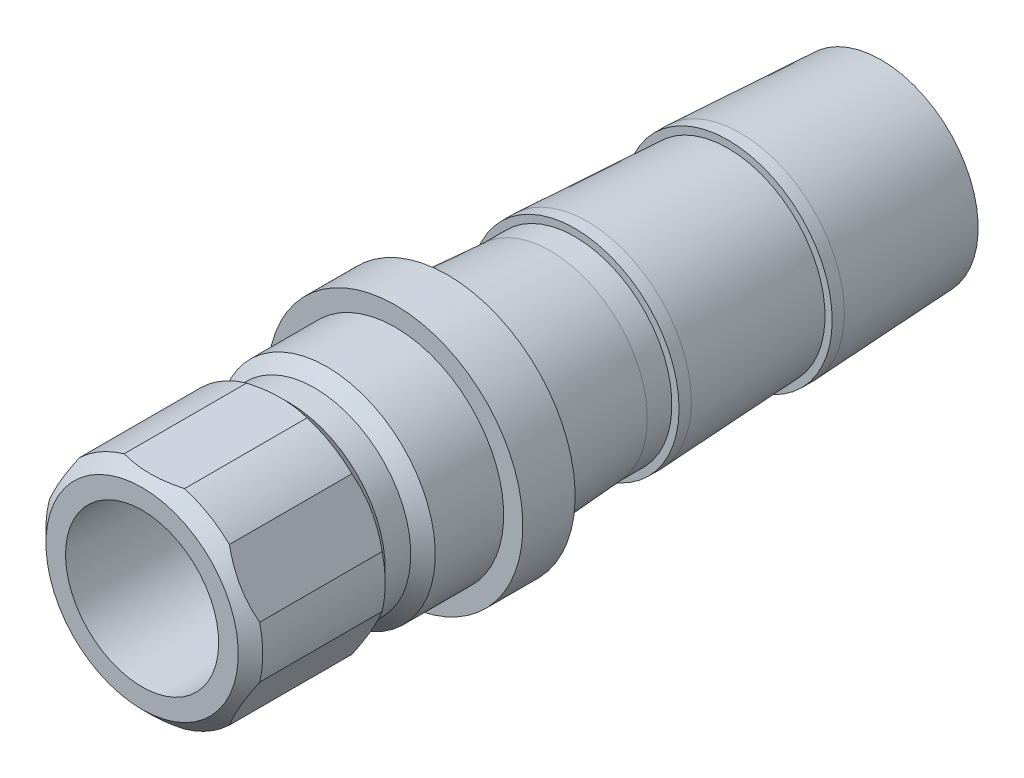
ISO-10303-21;
HEADER;
FILE_DESCRIPTION(('STEP AP214'),'2;1');
FILE_NAME('part.step','',(''),(''),'','','');
FILE_SCHEMA(('AUTOMOTIVE_DESIGN { 1 0 10303 214 1 1 1 1 }'));
ENDSEC;
DATA;
#1=APPLICATION_CONTEXT('core data for automotive mechanical design processes');
#2=APPLICATION_PROTOCOL_DEFINITION('international standard','automotive_design',2000,#1);
#3=PRODUCT_CONTEXT('',#1,'mechanical');
#4=PRODUCT('Part','Part','',(#3));
#5=PRODUCT_RELATED_PRODUCT_CATEGORY('part','',(#4));
#6=PRODUCT_DEFINITION_FORMATION('','',#4);
#7=PRODUCT_DEFINITION_CONTEXT('part definition',#1,'design');
#8=PRODUCT_DEFINITION('design','',#6,#7);
#9=PRODUCT_DEFINITION_SHAPE('','',#8);
#10=(LENGTH_UNIT() NAMED_UNIT(*) SI_UNIT(.MILLI.,.METRE.));
#11=(NAMED_UNIT(*) PLANE_ANGLE_UNIT() SI_UNIT($,.RADIAN.));
#12=(NAMED_UNIT(*) SI_UNIT($,.STERADIAN.) SOLID_ANGLE_UNIT());
#13=UNCERTAINTY_MEASURE_WITH_UNIT(LENGTH_MEASURE(1.E-05),#10,'distance_accuracy_value','');
#14=(GEOMETRIC_REPRESENTATION_CONTEXT(3) GLOBAL_UNCERTAINTY_ASSIGNED_CONTEXT((#13)) GLOBAL_UNIT_ASSIGNED_CONTEXT((#10,
#11,#12)) REPRESENTATION_CONTEXT('',''));
#15=CARTESIAN_POINT('',(0.,0.,0.));
#16=DIRECTION('',(0.,0.,1.));
#17=DIRECTION('',(1.,0.,0.));
#18=AXIS2_PLACEMENT_3D('',#15,#16,#17);
#19=CARTESIAN_POINT('',(0.,0.,14.986));
#20=DIRECTION('',(0.,0.,-1.));
#21=DIRECTION('',(0.,1.,0.));
#22=AXIS2_PLACEMENT_3D('',#19,#20,#21);
#23=CONICAL_SURFACE('',#22,6.7437,0.785398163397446);
#24=CARTESIAN_POINT('',(0.,0.,15.748));
#25=DIRECTION('',(0.,0.,-1.));
#26=DIRECTION('',(0.,1.,0.));
#27=AXIS2_PLACEMENT_3D('',#24,#25,#26);
#28=CIRCLE('',#27,5.9817);
#29=CARTESIAN_POINT('',(0.,5.9817,15.748));
#30=VERTEX_POINT('',#29);
#31=EDGE_CURVE('E162',#30,#30,#28,.T.);
#32=ORIENTED_EDGE('',*,*,#31,.T.);
#33=EDGE_LOOP('',(#32));
#34=FACE_BOUND('',#33,.T.);
#35=CARTESIAN_POINT('',(0.,0.,14.986));
#36=DIRECTION('',(0.,0.,-1.));
#37=DIRECTION('',(0.,1.,0.));
#38=AXIS2_PLACEMENT_3D('',#35,#36,#37);
#39=CIRCLE('',#38,6.7437);
#40=CARTESIAN_POINT('',(1.8777541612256,6.47699999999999,14.986));
#41=VERTEX_POINT('',#40);
#42=CARTESIAN_POINT('',(4.67036945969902,4.86468280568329,14.986));
#43=VERTEX_POINT('',#42);
#44=EDGE_CURVE('E159',#41,#43,#39,.T.);
#45=ORIENTED_EDGE('',*,*,#44,.F.);
#46=CARTESIAN_POINT('',(-7.31595245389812,6.477,11.9585849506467));
#47=CARTESIAN_POINT('',(-7.13716192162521,6.477,12.09242068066));
#48=CARTESIAN_POINT('',(-6.95735466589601,6.477,12.2249205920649));
#49=CARTESIAN_POINT('',(-6.59531185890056,6.477,12.4866559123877));
#50=CARTESIAN_POINT('',(-6.41307569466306,6.477,12.6158904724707));
#51=CARTESIAN_POINT('',(-6.04444818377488,6.477,12.8714195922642));
#52=CARTESIAN_POINT('',(-5.85803557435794,6.477,12.9976835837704));
#53=CARTESIAN_POINT('',(-5.4820225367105,6.477,13.245356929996));
#54=CARTESIAN_POINT('',(-5.29242233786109,6.477,13.3667666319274));
#55=CARTESIAN_POINT('',(-4.89908247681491,6.477,13.6101330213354));
#56=CARTESIAN_POINT('',(-4.69513615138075,6.477,13.7317573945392));
#57=CARTESIAN_POINT('',(-4.2824994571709,6.477,13.9668032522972));
#58=CARTESIAN_POINT('',(-4.07380836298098,6.477,14.0802234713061));
#59=CARTESIAN_POINT('',(-3.65173370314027,6.477,14.2964010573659));
#60=CARTESIAN_POINT('',(-3.43836632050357,6.477,14.3991897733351));
#61=CARTESIAN_POINT('',(-3.0059059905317,6.477,14.59180459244));
#62=CARTESIAN_POINT('',(-2.78681563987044,6.477,14.6816364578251));
#63=CARTESIAN_POINT('',(-2.35869152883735,6.477,14.8392509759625));
#64=CARTESIAN_POINT('',(-2.15007621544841,6.477,14.9081583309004));
#65=CARTESIAN_POINT('',(-1.72794730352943,6.477,15.029215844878));
#66=CARTESIAN_POINT('',(-1.51443335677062,6.477,15.0813648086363));
#67=CARTESIAN_POINT('',(-1.08726616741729,6.477,15.1653541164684));
#68=CARTESIAN_POINT('',(-0.873680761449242,6.477,15.1975339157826));
#69=CARTESIAN_POINT('',(-0.444382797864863,6.477,15.2409825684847));
#70=CARTESIAN_POINT('',(-0.228670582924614,6.477,15.2522547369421));
#71=CARTESIAN_POINT('',(0.195590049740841,6.477,15.2531049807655));
#72=CARTESIAN_POINT('',(0.404137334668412,6.477,15.2433943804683));
#73=CARTESIAN_POINT('',(0.819375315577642,6.477,15.2043531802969));
#74=CARTESIAN_POINT('',(1.026065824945,6.477,15.1750206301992));
#75=CARTESIAN_POINT('',(1.43958683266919,6.477,15.0978125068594));
#76=CARTESIAN_POINT('',(1.64635839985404,6.477,15.0496261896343));
#77=CARTESIAN_POINT('',(2.05541277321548,6.477,14.937237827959));
#78=CARTESIAN_POINT('',(2.25769600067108,6.477,14.8730372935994));
#79=CARTESIAN_POINT('',(2.67942290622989,6.477,14.7234325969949));
#80=CARTESIAN_POINT('',(2.89830973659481,6.477,14.6364736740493));
#81=CARTESIAN_POINT('',(3.33036785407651,6.477,14.4492510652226));
#82=CARTESIAN_POINT('',(3.5435363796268,6.477,14.3489810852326));
#83=CARTESIAN_POINT('',(3.96521765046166,6.477,14.1375266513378));
#84=CARTESIAN_POINT('',(4.17371291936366,6.477,14.026307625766));
#85=CARTESIAN_POINT('',(4.58589470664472,6.477,13.7954185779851));
#86=CARTESIAN_POINT('',(4.78958199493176,6.477,13.6757499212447));
#87=CARTESIAN_POINT('',(5.18271200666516,6.477,13.4357848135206));
#88=CARTESIAN_POINT('',(5.37235766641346,6.477,13.3158190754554));
#89=CARTESIAN_POINT('',(5.74839484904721,6.477,13.0708760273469));
#90=CARTESIAN_POINT('',(5.93478612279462,6.47699999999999,12.9458983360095));
#91=CARTESIAN_POINT('',(6.30322303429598,6.47699999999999,12.6928680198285));
#92=CARTESIAN_POINT('',(6.48529173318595,6.47699999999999,12.5648488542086));
#93=CARTESIAN_POINT('',(6.84694630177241,6.47699999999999,12.3054498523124));
#94=CARTESIAN_POINT('',(7.02653283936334,6.47699999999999,12.174070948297));
#95=CARTESIAN_POINT('',(7.20508094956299,6.47699999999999,12.041319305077));
#96=B_SPLINE_CURVE_WITH_KNOTS('',3,(#46,#47,#48,#49,#50,#51,#52,#53,#54,#55,#56,#57,#58,#59,#60,
#61,#62,#63,#64,#65,#66,#67,#68,#69,#70,#71,#72,#73,#74,#75,#76,#77,#78,#79,#80,#81,#82,#83,#84,
#85,#86,#87,#88,#89,#90,#91,#92,#93,#94,#95),.UNSPECIFIED.,.F.,.F.,(4,2,2,2,2,2,2,2,2,2,2,2,2,2,
2,2,2,2,2,2,2,2,2,2,4),(0.,0.670015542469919,1.34020350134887,2.01558827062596,2.69092464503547,
3.4031470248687,4.11547903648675,4.82564684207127,5.53549783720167,6.19401709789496,
6.85258331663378,7.49962373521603,8.14656155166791,8.77191276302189,9.39732613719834,
10.0335138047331,10.6696415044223,11.3756703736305,12.0820342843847,12.7907048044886,
13.4992610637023,14.1723809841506,14.845552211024,15.5132243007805,16.1807130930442),.UNSPECIFIED.);
#97=CARTESIAN_POINT('',(-1.87775416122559,6.477,14.986));
#98=VERTEX_POINT('',#97);
#99=EDGE_CURVE('E320',#41,#98,#96,.F.);
#100=ORIENTED_EDGE('',*,*,#99,.T.);
#101=CARTESIAN_POINT('',(-4.67036945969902,4.8646828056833,14.986));
#102=VERTEX_POINT('',#101);
#103=EDGE_CURVE('E156',#102,#98,#39,.T.);
#104=ORIENTED_EDGE('',*,*,#103,.F.);
#105=CARTESIAN_POINT('',(-4.67001038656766,4.86530473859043,14.9858));
#106=CARTESIAN_POINT('',(-4.75109443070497,4.72486305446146,15.0310202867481));
#107=CARTESIAN_POINT('',(-4.83292416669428,4.58312979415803,15.0711660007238));
#108=CARTESIAN_POINT('',(-4.99782619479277,4.2975111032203,15.1402365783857));
#109=CARTESIAN_POINT('',(-5.08089948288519,4.15362394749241,15.1691518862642));
#110=CARTESIAN_POINT('',(-5.24618595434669,3.86733938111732,15.2141425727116));
#111=CARTESIAN_POINT('',(-5.32838175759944,3.72497207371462,15.2304694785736));
#112=CARTESIAN_POINT('',(-5.49312242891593,3.43963286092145,15.2506210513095));
#113=CARTESIAN_POINT('',(-5.57566711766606,3.29666126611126,15.2544515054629));
#114=CARTESIAN_POINT('',(-5.73267022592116,3.0247239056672,15.2497120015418));
#115=CARTESIAN_POINT('',(-5.80713811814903,2.89574173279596,15.2423062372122));
#116=CARTESIAN_POINT('',(-5.95567411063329,2.63846984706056,15.2174303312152));
#117=CARTESIAN_POINT('',(-6.02974207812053,2.51018036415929,15.1999570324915));
#118=CARTESIAN_POINT('',(-6.17854717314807,2.25244237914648,15.1550584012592));
#119=CARTESIAN_POINT('',(-6.2532703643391,2.12301801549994,15.127450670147));
#120=CARTESIAN_POINT('',(-6.40168890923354,1.86594955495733,15.0631944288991));
#121=CARTESIAN_POINT('',(-6.4753849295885,1.7383043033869,15.0265521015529));
#122=CARTESIAN_POINT('',(-6.54848269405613,1.61169526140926,14.9857999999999));
#123=B_SPLINE_CURVE_WITH_KNOTS('',3,(#105,#106,#107,#108,#109,#110,#111,#112,#113,#114,#115,
#116,#117,#118,#119,#120,#121,#122),.UNSPECIFIED.,.F.,.F.,(4,2,2,2,2,2,2,2,4),(0.,
0.505093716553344,1.01061627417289,1.50575564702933,2.00066568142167,2.44768005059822,
2.89483467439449,3.35046683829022,3.80578805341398),.UNSPECIFIED.);
#124=CARTESIAN_POINT('',(-6.5481236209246,1.6123171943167,14.986));
#125=VERTEX_POINT('',#124);
#126=EDGE_CURVE('E191',#102,#125,#123,.T.);
#127=ORIENTED_EDGE('',*,*,#126,.T.);
#128=CARTESIAN_POINT('',(-6.5481236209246,-1.61231719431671,14.986));
#129=VERTEX_POINT('',#128);
#130=EDGE_CURVE('E143',#129,#125,#39,.T.);
#131=ORIENTED_EDGE('',*,*,#130,.F.);
#132=CARTESIAN_POINT('',(-6.5484826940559,-1.61169526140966,14.9858));
#133=CARTESIAN_POINT('',(-6.4673986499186,-1.75213694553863,15.0310202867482));
#134=CARTESIAN_POINT('',(-6.38556891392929,-1.89387020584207,15.0711660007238));
#135=CARTESIAN_POINT('',(-6.2206668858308,-2.1794888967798,15.1402365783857));
#136=CARTESIAN_POINT('',(-6.13759359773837,-2.32337605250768,15.1691518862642));
#137=CARTESIAN_POINT('',(-5.97230712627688,-2.60966061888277,15.2141425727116));
#138=CARTESIAN_POINT('',(-5.89011132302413,-2.75202792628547,15.2304694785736));
#139=CARTESIAN_POINT('',(-5.72537065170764,-3.03736713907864,15.2506210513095));
#140=CARTESIAN_POINT('',(-5.64282596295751,-3.18033873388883,15.2544515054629));
#141=CARTESIAN_POINT('',(-5.48582285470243,-3.45227609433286,15.2497120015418));
#142=CARTESIAN_POINT('',(-5.41135496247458,-3.58125826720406,15.2423062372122));
#143=CARTESIAN_POINT('',(-5.26281896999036,-3.83853015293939,15.2174303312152));
#144=CARTESIAN_POINT('',(-5.18875100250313,-3.96681963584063,15.1999570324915));
#145=CARTESIAN_POINT('',(-5.03994590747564,-4.22455762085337,15.1550584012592));
#146=CARTESIAN_POINT('',(-4.96522271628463,-4.35398198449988,15.1274506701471));
#147=CARTESIAN_POINT('',(-4.81680417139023,-4.61105044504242,15.0631944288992));
#148=CARTESIAN_POINT('',(-4.74310815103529,-4.7386956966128,15.026552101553));
#149=CARTESIAN_POINT('',(-4.67001038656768,-4.86530473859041,14.9858));
#150=B_SPLINE_CURVE_WITH_KNOTS('',3,(#132,#133,#134,#135,#136,#137,#138,#139,#140,#141,#142,
#143,#144,#145,#146,#147,#148,#149),.UNSPECIFIED.,.F.,.F.,(4,2,2,2,2,2,2,2,4),(0.,
0.505093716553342,1.01061627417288,1.50575564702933,2.00066568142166,2.44768005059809,
2.89483467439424,3.35046683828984,3.80578805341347),.UNSPECIFIED.);
#151=CARTESIAN_POINT('',(-4.67036945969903,-4.86468280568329,14.986));
#152=VERTEX_POINT('',#151);
#153=EDGE_CURVE('E211',#129,#152,#150,.T.);
#154=ORIENTED_EDGE('',*,*,#153,.T.);
#155=CARTESIAN_POINT('',(-1.87775416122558,-6.477,14.986));
#156=VERTEX_POINT('',#155);
#157=EDGE_CURVE('E289',#156,#152,#39,.T.);
#158=ORIENTED_EDGE('',*,*,#157,.F.);
#159=CARTESIAN_POINT('',(-7.31595245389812,-6.477,11.9585849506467));
#160=CARTESIAN_POINT('',(-7.13716192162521,-6.477,12.09242068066));
#161=CARTESIAN_POINT('',(-6.95735466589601,-6.477,12.2249205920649));
#162=CARTESIAN_POINT('',(-6.59531185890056,-6.477,12.4866559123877));
#163=CARTESIAN_POINT('',(-6.41307569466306,-6.477,12.6158904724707));
#164=CARTESIAN_POINT('',(-6.04444818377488,-6.477,12.8714195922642));
#165=CARTESIAN_POINT('',(-5.85803557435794,-6.477,12.9976835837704));
#166=CARTESIAN_POINT('',(-5.48202253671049,-6.477,13.245356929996));
#167=CARTESIAN_POINT('',(-5.29242233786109,-6.477,13.3667666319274));
#168=CARTESIAN_POINT('',(-4.89908247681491,-6.477,13.6101330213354));
#169=CARTESIAN_POINT('',(-4.69513615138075,-6.477,13.7317573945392));
#170=CARTESIAN_POINT('',(-4.2824994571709,-6.477,13.9668032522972));
#171=CARTESIAN_POINT('',(-4.07380836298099,-6.477,14.0802234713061));
#172=CARTESIAN_POINT('',(-3.65173370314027,-6.477,14.2964010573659));
#173=CARTESIAN_POINT('',(-3.43836632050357,-6.477,14.3991897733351));
#174=CARTESIAN_POINT('',(-3.0059059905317,-6.477,14.59180459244));
#175=CARTESIAN_POINT('',(-2.78681563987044,-6.477,14.6816364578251));
#176=CARTESIAN_POINT('',(-2.35869152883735,-6.477,14.8392509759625));
#177=CARTESIAN_POINT('',(-2.15007621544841,-6.477,14.9081583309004));
#178=CARTESIAN_POINT('',(-1.72794730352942,-6.477,15.029215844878));
#179=CARTESIAN_POINT('',(-1.51443335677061,-6.477,15.0813648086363));
#180=CARTESIAN_POINT('',(-1.08726616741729,-6.477,15.1653541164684));
#181=CARTESIAN_POINT('',(-0.873680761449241,-6.477,15.1975339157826));
#182=CARTESIAN_POINT('',(-0.444382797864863,-6.477,15.2409825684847));
#183=CARTESIAN_POINT('',(-0.228670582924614,-6.477,15.2522547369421));
#184=CARTESIAN_POINT('',(0.19559004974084,-6.477,15.2531049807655));
#185=CARTESIAN_POINT('',(0.40413733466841,-6.477,15.2433943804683));
#186=CARTESIAN_POINT('',(0.819375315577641,-6.477,15.2043531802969));
#187=CARTESIAN_POINT('',(1.026065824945,-6.477,15.1750206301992));
#188=CARTESIAN_POINT('',(1.43958683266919,-6.477,15.0978125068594));
#189=CARTESIAN_POINT('',(1.64635839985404,-6.477,15.0496261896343));
#190=CARTESIAN_POINT('',(2.05541277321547,-6.477,14.937237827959));
#191=CARTESIAN_POINT('',(2.25769600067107,-6.477,14.8730372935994));
#192=CARTESIAN_POINT('',(2.67942290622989,-6.477,14.7234325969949));
#193=CARTESIAN_POINT('',(2.89830973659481,-6.477,14.6364736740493));
#194=CARTESIAN_POINT('',(3.33036785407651,-6.477,14.4492510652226));
#195=CARTESIAN_POINT('',(3.5435363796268,-6.477,14.3489810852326));
#196=CARTESIAN_POINT('',(3.96521765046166,-6.477,14.1375266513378));
#197=CARTESIAN_POINT('',(4.17371291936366,-6.477,14.026307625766));
#198=CARTESIAN_POINT('',(4.58589470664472,-6.477,13.7954185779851));
#199=CARTESIAN_POINT('',(4.78958199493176,-6.477,13.6757499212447));
#200=CARTESIAN_POINT('',(5.18271200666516,-6.477,13.4357848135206));
#201=CARTESIAN_POINT('',(5.37235766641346,-6.477,13.3158190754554));
#202=CARTESIAN_POINT('',(5.74839484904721,-6.477,13.0708760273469));
#203=CARTESIAN_POINT('',(5.93478612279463,-6.477,12.9458983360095));
#204=CARTESIAN_POINT('',(6.30322303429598,-6.477,12.6928680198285));
#205=CARTESIAN_POINT('',(6.48529173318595,-6.477,12.5648488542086));
#206=CARTESIAN_POINT('',(6.8469463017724,-6.477,12.3054498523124));
#207=CARTESIAN_POINT('',(7.02653283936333,-6.477,12.174070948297));
#208=CARTESIAN_POINT('',(7.20508094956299,-6.477,12.041319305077));
#209=B_SPLINE_CURVE_WITH_KNOTS('',3,(#159,#160,#161,#162,#163,#164,#165,#166,#167,#168,#169,
#170,#171,#172,#173,#174,#175,#176,#177,#178,#179,#180,#181,#182,#183,#184,#185,#186,#187,#188,
#189,#190,#191,#192,#193,#194,#195,#196,#197,#198,#199,#200,#201,#202,#203,#204,#205,#206,#207,
#208),.UNSPECIFIED.,.F.,.F.,(4,2,2,2,2,2,2,2,2,2,2,2,2,2,2,2,2,2,2,2,2,2,2,2,4),(0.,
0.670015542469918,1.34020350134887,2.01558827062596,2.69092464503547,3.4031470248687,
4.11547903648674,4.82564684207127,5.53549783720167,6.19401709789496,6.85258331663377,
7.49962373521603,8.1465615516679,8.77191276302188,9.39732613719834,10.0335138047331,
10.6696415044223,11.3756703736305,12.0820342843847,12.7907048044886,13.4992610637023,
14.1723809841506,14.845552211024,15.5132243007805,16.1807130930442),.UNSPECIFIED.);
#210=CARTESIAN_POINT('',(1.87775416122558,-6.477,14.986));
#211=VERTEX_POINT('',#210);
#212=EDGE_CURVE('E218',#156,#211,#209,.T.);
#213=ORIENTED_EDGE('',*,*,#212,.T.);
#214=CARTESIAN_POINT('',(4.67036945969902,-4.8646828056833,14.986));
#215=VERTEX_POINT('',#214);
#216=EDGE_CURVE('E297',#215,#211,#39,.T.);
#217=ORIENTED_EDGE('',*,*,#216,.F.);
#218=CARTESIAN_POINT('',(4.67001038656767,-4.86530473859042,14.9858));
#219=CARTESIAN_POINT('',(4.75109443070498,-4.72486305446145,15.0310202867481));
#220=CARTESIAN_POINT('',(4.83292416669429,-4.58312979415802,15.0711660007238));
#221=CARTESIAN_POINT('',(4.99782619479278,-4.29751110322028,15.1402365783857));
#222=CARTESIAN_POINT('',(5.0808994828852,-4.1536239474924,15.1691518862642));
#223=CARTESIAN_POINT('',(5.24618595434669,-3.86733938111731,15.2141425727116));
#224=CARTESIAN_POINT('',(5.32838175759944,-3.72497207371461,15.2304694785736));
#225=CARTESIAN_POINT('',(5.49312242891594,-3.43963286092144,15.2506210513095));
#226=CARTESIAN_POINT('',(5.57566711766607,-3.29666126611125,15.2544515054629));
#227=CARTESIAN_POINT('',(5.73267022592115,-3.02472390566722,15.2497120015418));
#228=CARTESIAN_POINT('',(5.807138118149,-2.89574173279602,15.2423062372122));
#229=CARTESIAN_POINT('',(5.95567411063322,-2.63846984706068,15.2174303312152));
#230=CARTESIAN_POINT('',(6.02974207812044,-2.51018036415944,15.1999570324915));
#231=CARTESIAN_POINT('',(6.17854717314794,-2.25244237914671,15.1550584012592));
#232=CARTESIAN_POINT('',(6.25327036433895,-2.1230180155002,15.1274506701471));
#233=CARTESIAN_POINT('',(6.40168890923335,-1.86594955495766,15.0631944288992));
#234=CARTESIAN_POINT('',(6.47538492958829,-1.73830430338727,15.026552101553));
#235=CARTESIAN_POINT('',(6.5484826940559,-1.61169526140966,14.9858));
#236=B_SPLINE_CURVE_WITH_KNOTS('',3,(#218,#219,#220,#221,#222,#223,#224,#225,#226,#227,#228,
#229,#230,#231,#232,#233,#234,#235),.UNSPECIFIED.,.F.,.F.,(4,2,2,2,2,2,2,2,4),(0.,
0.505093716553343,1.01061627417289,1.50575564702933,2.00066568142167,2.4476800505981,
2.89483467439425,3.35046683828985,3.80578805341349),.UNSPECIFIED.);
#237=CARTESIAN_POINT('',(6.5481236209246,-1.61231719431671,14.986));
#238=VERTEX_POINT('',#237);
#239=EDGE_CURVE('E225',#215,#238,#236,.T.);
#240=ORIENTED_EDGE('',*,*,#239,.T.);
#241=CARTESIAN_POINT('',(6.5481236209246,1.6123171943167,14.986));
#242=VERTEX_POINT('',#241);
#243=EDGE_CURVE('E163',#242,#238,#39,.T.);
#244=ORIENTED_EDGE('',*,*,#243,.F.);
#245=CARTESIAN_POINT('',(6.54848269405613,1.61169526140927,14.9857999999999));
#246=CARTESIAN_POINT('',(6.46739864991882,1.75213694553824,15.031020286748));
#247=CARTESIAN_POINT('',(6.38556891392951,1.89387020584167,15.0711660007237));
#248=CARTESIAN_POINT('',(6.22066688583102,2.17948889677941,15.1402365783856));
#249=CARTESIAN_POINT('',(6.1375935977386,2.32337605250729,15.1691518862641));
#250=CARTESIAN_POINT('',(5.9723071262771,2.60966061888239,15.2141425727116));
#251=CARTESIAN_POINT('',(5.89011132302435,2.75202792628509,15.2304694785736));
#252=CARTESIAN_POINT('',(5.72537065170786,3.03736713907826,15.2506210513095));
#253=CARTESIAN_POINT('',(5.64282596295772,3.18033873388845,15.2544515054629));
#254=CARTESIAN_POINT('',(5.48582285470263,3.45227609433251,15.2497120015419));
#255=CARTESIAN_POINT('',(5.41135496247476,3.58125826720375,15.2423062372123));
#256=CARTESIAN_POINT('',(5.2628189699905,3.83853015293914,15.2174303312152));
#257=CARTESIAN_POINT('',(5.18875100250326,3.96681963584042,15.1999570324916));
#258=CARTESIAN_POINT('',(5.03994590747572,4.22455762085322,15.1550584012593));
#259=CARTESIAN_POINT('',(4.96522271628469,4.35398198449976,15.1274506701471));
#260=CARTESIAN_POINT('',(4.81680417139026,4.61105044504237,15.0631944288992));
#261=CARTESIAN_POINT('',(4.7431081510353,4.73869569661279,15.026552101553));
#262=CARTESIAN_POINT('',(4.67001038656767,4.86530473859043,14.9858));
#263=B_SPLINE_CURVE_WITH_KNOTS('',3,(#245,#246,#247,#248,#249,#250,#251,#252,#253,#254,#255,
#256,#257,#258,#259,#260,#261,#262),.UNSPECIFIED.,.F.,.F.,(4,2,2,2,2,2,2,2,4),(0.,
0.505093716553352,1.0106162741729,1.50575564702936,2.0006656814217,2.44768005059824,
2.8948346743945,3.35046683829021,3.80578805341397),.UNSPECIFIED.);
#264=EDGE_CURVE('E233',#242,#43,#263,.T.);
#265=ORIENTED_EDGE('',*,*,#264,.T.);
#266=EDGE_LOOP('',(#45,#100,#104,#127,#131,#154,#158,#213,#217,#240,#244,#265));
#267=FACE_BOUND('',#266,.T.);
#268=ADVANCED_FACE('F34',(#34,#267),#23,.T.);
#269=CARTESIAN_POINT('',(0.,0.,0.));
#270=DIRECTION('',(0.,0.,-1.));
#271=DIRECTION('',(0.,1.,0.));
#272=AXIS2_PLACEMENT_3D('',#269,#270,#271);
#273=CYLINDRICAL_SURFACE('',#272,6.7437);
#274=CARTESIAN_POINT('',(0.,0.,7.36599999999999));
#275=DIRECTION('',(0.,0.,-1.));
#276=DIRECTION('',(0.,1.,0.));
#277=AXIS2_PLACEMENT_3D('',#274,#275,#276);
#278=CIRCLE('',#277,6.7437);
#279=CARTESIAN_POINT('',(1.87775416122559,6.477,7.36599999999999));
#280=VERTEX_POINT('',#279);
#281=CARTESIAN_POINT('',(4.67036945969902,4.86468280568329,7.36599999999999));
#282=VERTEX_POINT('',#281);
#283=EDGE_CURVE('E152',#280,#282,#278,.T.);
#284=ORIENTED_EDGE('',*,*,#283,.F.);
#285=DIRECTION('',(0.,0.,-1.));
#286=VECTOR('',#285,1.);
#287=CARTESIAN_POINT('',(1.8777541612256,6.477,0.));
#288=LINE('',#287,#286);
#289=EDGE_CURVE('E324',#280,#41,#288,.F.);
#290=ORIENTED_EDGE('',*,*,#289,.T.);
#291=ORIENTED_EDGE('',*,*,#44,.T.);
#292=DIRECTION('',(0.,0.,-1.));
#293=VECTOR('',#292,1.);
#294=CARTESIAN_POINT('',(4.67036945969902,4.86468280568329,0.));
#295=LINE('',#294,#293);
#296=EDGE_CURVE('E307',#43,#282,#295,.T.);
#297=ORIENTED_EDGE('',*,*,#296,.T.);
#298=EDGE_LOOP('',(#284,#290,#291,#297));
#299=FACE_BOUND('',#298,.T.);
#300=ADVANCED_FACE('F202',(#299),#273,.T.);
#301=ORIENTED_EDGE('',*,*,#103,.T.);
#302=DIRECTION('',(0.,0.,-1.));
#303=VECTOR('',#302,1.);
#304=CARTESIAN_POINT('',(-1.87775416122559,6.477,0.));
#305=LINE('',#304,#303);
#306=CARTESIAN_POINT('',(-1.87775416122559,6.477,7.36599999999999));
#307=VERTEX_POINT('',#306);
#308=EDGE_CURVE('E241',#98,#307,#305,.T.);
#309=ORIENTED_EDGE('',*,*,#308,.T.);
#310=CARTESIAN_POINT('',(-4.67036945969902,4.86468280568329,7.36599999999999));
#311=VERTEX_POINT('',#310);
#312=EDGE_CURVE('E148',#311,#307,#278,.T.);
#313=ORIENTED_EDGE('',*,*,#312,.F.);
#314=DIRECTION('',(0.,0.,-1.));
#315=VECTOR('',#314,1.);
#316=CARTESIAN_POINT('',(-4.67036945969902,4.8646828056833,0.));
#317=LINE('',#316,#315);
#318=EDGE_CURVE('E54',#311,#102,#317,.F.);
#319=ORIENTED_EDGE('',*,*,#318,.T.);
#320=EDGE_LOOP('',(#301,#309,#313,#319));
#321=FACE_BOUND('',#320,.T.);
#322=ADVANCED_FACE('F318',(#321),#273,.T.);
#323=CARTESIAN_POINT('',(6.5481236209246,1.61231719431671,7.36599999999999));
#324=VERTEX_POINT('',#323);
#325=CARTESIAN_POINT('',(6.5481236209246,-1.61231719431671,7.36599999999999));
#326=VERTEX_POINT('',#325);
#327=EDGE_CURVE('E157',#324,#326,#278,.T.);
#328=ORIENTED_EDGE('',*,*,#327,.F.);
#329=DIRECTION('',(0.,0.,-1.));
#330=VECTOR('',#329,1.);
#331=CARTESIAN_POINT('',(6.5481236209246,1.61231719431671,0.));
#332=LINE('',#331,#330);
#333=EDGE_CURVE('E242',#324,#242,#332,.F.);
#334=ORIENTED_EDGE('',*,*,#333,.T.);
#335=ORIENTED_EDGE('',*,*,#243,.T.);
#336=DIRECTION('',(0.,0.,-1.));
#337=VECTOR('',#336,1.);
#338=CARTESIAN_POINT('',(6.5481236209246,-1.6123171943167,0.));
#339=LINE('',#338,#337);
#340=EDGE_CURVE('E300',#238,#326,#339,.T.);
#341=ORIENTED_EDGE('',*,*,#340,.T.);
#342=EDGE_LOOP('',(#328,#334,#335,#341));
#343=FACE_BOUND('',#342,.T.);
#344=ADVANCED_FACE('F313',(#343),#273,.T.);
#345=CARTESIAN_POINT('',(4.67036945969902,-4.86468280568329,7.36599999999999));
#346=VERTEX_POINT('',#345);
#347=CARTESIAN_POINT('',(1.87775416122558,-6.477,7.36599999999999));
#348=VERTEX_POINT('',#347);
#349=EDGE_CURVE('E150',#346,#348,#278,.T.);
#350=ORIENTED_EDGE('',*,*,#349,.F.);
#351=DIRECTION('',(0.,0.,-1.));
#352=VECTOR('',#351,1.);
#353=CARTESIAN_POINT('',(4.67036945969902,-4.8646828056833,0.));
#354=LINE('',#353,#352);
#355=EDGE_CURVE('E302',#346,#215,#354,.F.);
#356=ORIENTED_EDGE('',*,*,#355,.T.);
#357=ORIENTED_EDGE('',*,*,#216,.T.);
#358=DIRECTION('',(0.,0.,-1.));
#359=VECTOR('',#358,1.);
#360=CARTESIAN_POINT('',(1.87775416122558,-6.477,0.));
#361=LINE('',#360,#359);
#362=EDGE_CURVE('E284',#211,#348,#361,.T.);
#363=ORIENTED_EDGE('',*,*,#362,.T.);
#364=EDGE_LOOP('',(#350,#356,#357,#363));
#365=FACE_BOUND('',#364,.T.);
#366=ADVANCED_FACE('F294',(#365),#273,.T.);
#367=CARTESIAN_POINT('',(-1.87775416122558,-6.477,7.36599999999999));
#368=VERTEX_POINT('',#367);
#369=CARTESIAN_POINT('',(-4.67036945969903,-4.86468280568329,7.36599999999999));
#370=VERTEX_POINT('',#369);
#371=EDGE_CURVE('E147',#368,#370,#278,.T.);
#372=ORIENTED_EDGE('',*,*,#371,.F.);
#373=DIRECTION('',(0.,0.,-1.));
#374=VECTOR('',#373,1.);
#375=CARTESIAN_POINT('',(-1.87775416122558,-6.477,0.));
#376=LINE('',#375,#374);
#377=EDGE_CURVE('E277',#368,#156,#376,.F.);
#378=ORIENTED_EDGE('',*,*,#377,.T.);
#379=ORIENTED_EDGE('',*,*,#157,.T.);
#380=DIRECTION('',(0.,0.,-1.));
#381=VECTOR('',#380,1.);
#382=CARTESIAN_POINT('',(-4.67036945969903,-4.86468280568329,0.));
#383=LINE('',#382,#381);
#384=EDGE_CURVE('E198',#152,#370,#383,.T.);
#385=ORIENTED_EDGE('',*,*,#384,.T.);
#386=EDGE_LOOP('',(#372,#378,#379,#385));
#387=FACE_BOUND('',#386,.T.);
#388=ADVANCED_FACE('F288',(#387),#273,.T.);
#389=CARTESIAN_POINT('',(-6.5481236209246,-1.61231719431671,7.36599999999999));
#390=VERTEX_POINT('',#389);
#391=CARTESIAN_POINT('',(-6.5481236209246,1.6123171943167,7.36599999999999));
#392=VERTEX_POINT('',#391);
#393=EDGE_CURVE('E141',#390,#392,#278,.T.);
#394=ORIENTED_EDGE('',*,*,#393,.F.);
#395=DIRECTION('',(0.,0.,-1.));
#396=VECTOR('',#395,1.);
#397=CARTESIAN_POINT('',(-6.5481236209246,-1.61231719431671,0.));
#398=LINE('',#397,#396);
#399=EDGE_CURVE('E62',#390,#129,#398,.F.);
#400=ORIENTED_EDGE('',*,*,#399,.T.);
#401=ORIENTED_EDGE('',*,*,#130,.T.);
#402=DIRECTION('',(0.,0.,-1.));
#403=VECTOR('',#402,1.);
#404=CARTESIAN_POINT('',(-6.5481236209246,1.6123171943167,0.));
#405=LINE('',#404,#403);
#406=EDGE_CURVE('E128',#125,#392,#405,.T.);
#407=ORIENTED_EDGE('',*,*,#406,.T.);
#408=EDGE_LOOP('',(#394,#400,#401,#407));
#409=FACE_BOUND('',#408,.T.);
#410=ADVANCED_FACE('F140',(#409),#273,.T.);
#411=CARTESIAN_POINT('',(0.,0.,6.604));
#412=DIRECTION('',(0.,0.,1.));
#413=DIRECTION('',(0.,-1.,0.));
#414=AXIS2_PLACEMENT_3D('',#411,#412,#413);
#415=CONICAL_SURFACE('',#414,5.9817,0.785398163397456);
#416=CARTESIAN_POINT('',(0.,0.,6.604));
#417=DIRECTION('',(0.,0.,-1.));
#418=DIRECTION('',(0.,1.,0.));
#419=AXIS2_PLACEMENT_3D('',#416,#417,#418);
#420=CIRCLE('',#419,5.9817);
#421=CARTESIAN_POINT('',(0.,5.9817,6.604));
#422=VERTEX_POINT('',#421);
#423=EDGE_CURVE('E151',#422,#422,#420,.T.);
#424=ORIENTED_EDGE('',*,*,#423,.F.);
#425=EDGE_LOOP('',(#424));
#426=FACE_BOUND('',#425,.T.);
#427=ORIENTED_EDGE('',*,*,#312,.T.);
#428=CARTESIAN_POINT('',(-7.31595245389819,6.477,10.3934150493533));
#429=CARTESIAN_POINT('',(-7.13716192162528,6.477,10.25957931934));
#430=CARTESIAN_POINT('',(-6.95735466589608,6.477,10.1270794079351));
#431=CARTESIAN_POINT('',(-6.59531185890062,6.477,9.86534408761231));
#432=CARTESIAN_POINT('',(-6.41307569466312,6.477,9.7361095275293));
#433=CARTESIAN_POINT('',(-6.04444818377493,6.477,9.48058040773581));
#434=CARTESIAN_POINT('',(-5.85803557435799,6.477,9.35431641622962));
#435=CARTESIAN_POINT('',(-5.48202253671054,6.477,9.10664307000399));
#436=CARTESIAN_POINT('',(-5.29242233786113,6.477,8.98523336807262));
#437=CARTESIAN_POINT('',(-4.89908247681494,6.477,8.74186697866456));
#438=CARTESIAN_POINT('',(-4.69513615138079,6.477,8.62024260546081));
#439=CARTESIAN_POINT('',(-4.28249945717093,6.477,8.38519674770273));
#440=CARTESIAN_POINT('',(-4.07380836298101,6.477,8.27177652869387));
#441=CARTESIAN_POINT('',(-3.65173370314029,6.477,8.05559894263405));
#442=CARTESIAN_POINT('',(-3.43836632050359,6.477,7.95281022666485));
#443=CARTESIAN_POINT('',(-3.00590599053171,6.477,7.76019540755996));
#444=CARTESIAN_POINT('',(-2.78681563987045,6.477,7.67036354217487));
#445=CARTESIAN_POINT('',(-2.35869152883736,6.477,7.51274902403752));
#446=CARTESIAN_POINT('',(-2.15007621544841,6.477,7.4438416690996));
#447=CARTESIAN_POINT('',(-1.72794730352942,6.477,7.32278415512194));
#448=CARTESIAN_POINT('',(-1.5144333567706,6.477,7.27063519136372));
#449=CARTESIAN_POINT('',(-1.08726616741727,6.477,7.18664588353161));
#450=CARTESIAN_POINT('',(-0.873680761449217,6.477,7.15446608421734));
#451=CARTESIAN_POINT('',(-0.444382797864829,6.477,7.1110174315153));
#452=CARTESIAN_POINT('',(-0.228670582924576,6.477,7.09974526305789));
#453=CARTESIAN_POINT('',(0.195590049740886,6.477,7.09889501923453));
#454=CARTESIAN_POINT('',(0.404137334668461,6.477,7.10860561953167));
#455=CARTESIAN_POINT('',(0.819375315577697,6.477,7.14764681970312));
#456=CARTESIAN_POINT('',(1.02606582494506,6.477,7.1769793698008));
#457=CARTESIAN_POINT('',(1.43958683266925,6.477,7.25418749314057));
#458=CARTESIAN_POINT('',(1.64635839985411,6.477,7.30237381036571));
#459=CARTESIAN_POINT('',(2.05541277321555,6.477,7.41476217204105));
#460=CARTESIAN_POINT('',(2.25769600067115,6.477,7.47896270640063));
#461=CARTESIAN_POINT('',(2.67942290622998,6.477,7.62856740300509));
#462=CARTESIAN_POINT('',(2.89830973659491,6.477,7.7155263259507));
#463=CARTESIAN_POINT('',(3.33036785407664,6.477,7.90274893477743));
#464=CARTESIAN_POINT('',(3.54353637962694,6.477,8.00301891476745));
#465=CARTESIAN_POINT('',(3.96521765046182,6.477,8.21447334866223));
#466=CARTESIAN_POINT('',(4.17371291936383,6.477,8.32569237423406));
#467=CARTESIAN_POINT('',(4.58589470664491,6.477,8.55658142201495));
#468=CARTESIAN_POINT('',(4.78958199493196,6.477,8.6762500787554));
#469=CARTESIAN_POINT('',(5.18271200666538,6.477,8.91621518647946));
#470=CARTESIAN_POINT('',(5.3723576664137,6.477,9.03618092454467));
#471=CARTESIAN_POINT('',(5.74839484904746,6.477,9.28112397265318));
#472=CARTESIAN_POINT('',(5.93478612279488,6.47699999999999,9.40610166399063));
#473=CARTESIAN_POINT('',(6.30322303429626,6.47699999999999,9.65913198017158));
#474=CARTESIAN_POINT('',(6.48529173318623,6.47699999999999,9.78715114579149));
#475=CARTESIAN_POINT('',(6.84694630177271,6.47699999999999,10.0465501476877));
#476=CARTESIAN_POINT('',(7.02653283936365,6.47699999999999,10.1779290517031));
#477=CARTESIAN_POINT('',(7.20508094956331,6.47699999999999,10.3106806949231));
#478=B_SPLINE_CURVE_WITH_KNOTS('',3,(#428,#429,#430,#431,#432,#433,#434,#435,#436,#437,#438,
#439,#440,#441,#442,#443,#444,#445,#446,#447,#448,#449,#450,#451,#452,#453,#454,#455,#456,#457,
#458,#459,#460,#461,#462,#463,#464,#465,#466,#467,#468,#469,#470,#471,#472,#473,#474,#475,#476,
#477),.UNSPECIFIED.,.F.,.F.,(4,2,2,2,2,2,2,2,2,2,2,2,2,2,2,2,2,2,2,2,2,2,2,2,4),(0.,
0.670015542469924,1.34020350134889,2.01558827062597,2.69092464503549,3.40314702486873,
4.11547903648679,4.82564684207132,5.53549783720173,6.19401709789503,6.85258331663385,
7.49962373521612,8.14656155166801,8.771912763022,9.39732613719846,10.0335138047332,
10.6696415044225,11.3756703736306,12.0820342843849,12.7907048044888,13.4992610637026,
14.172380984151,14.8455522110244,15.5132243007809,16.1807130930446),.UNSPECIFIED.);
#479=EDGE_CURVE('E12',#307,#280,#478,.T.);
#480=ORIENTED_EDGE('',*,*,#479,.T.);
#481=ORIENTED_EDGE('',*,*,#283,.T.);
#482=CARTESIAN_POINT('',(4.67001038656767,4.86530473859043,7.36620000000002));
#483=CARTESIAN_POINT('',(4.75109443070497,4.72486305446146,7.32097971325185));
#484=CARTESIAN_POINT('',(4.83292416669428,4.58312979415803,7.28083399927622));
#485=CARTESIAN_POINT('',(4.99782619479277,4.29751110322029,7.21176342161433));
#486=CARTESIAN_POINT('',(5.08089948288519,4.15362394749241,7.18284811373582));
#487=CARTESIAN_POINT('',(5.24618595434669,3.86733938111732,7.13785742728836));
#488=CARTESIAN_POINT('',(5.32838175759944,3.72497207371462,7.12153052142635));
#489=CARTESIAN_POINT('',(5.49312242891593,3.43963286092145,7.10137894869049));
#490=CARTESIAN_POINT('',(5.57566711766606,3.29666126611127,7.09754849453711));
#491=CARTESIAN_POINT('',(5.73267022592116,3.0247239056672,7.10228799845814));
#492=CARTESIAN_POINT('',(5.80713811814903,2.89574173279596,7.10969376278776));
#493=CARTESIAN_POINT('',(5.95567411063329,2.63846984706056,7.13456966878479));
#494=CARTESIAN_POINT('',(6.02974207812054,2.51018036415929,7.15204296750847));
#495=CARTESIAN_POINT('',(6.17854717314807,2.25244237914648,7.19694159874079));
#496=CARTESIAN_POINT('',(6.2532703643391,2.12301801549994,7.22454932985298));
#497=CARTESIAN_POINT('',(6.40168890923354,1.86594955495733,7.28880557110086));
#498=CARTESIAN_POINT('',(6.4753849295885,1.73830430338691,7.32544789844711));
#499=CARTESIAN_POINT('',(6.54848269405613,1.61169526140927,7.36620000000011));
#500=B_SPLINE_CURVE_WITH_KNOTS('',3,(#482,#483,#484,#485,#486,#487,#488,#489,#490,#491,#492,
#493,#494,#495,#496,#497,#498,#499),.UNSPECIFIED.,.F.,.F.,(4,2,2,2,2,2,2,2,4),(0.,
0.505093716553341,1.01061627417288,1.50575564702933,2.00066568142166,2.44768005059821,
2.89483467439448,3.35046683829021,3.80578805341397),.UNSPECIFIED.);
#501=EDGE_CURVE('E47',#282,#324,#500,.T.);
#502=ORIENTED_EDGE('',*,*,#501,.T.);
#503=ORIENTED_EDGE('',*,*,#327,.T.);
#504=CARTESIAN_POINT('',(6.5484826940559,-1.61169526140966,7.36619999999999));
#505=CARTESIAN_POINT('',(6.4673986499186,-1.75213694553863,7.32097971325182));
#506=CARTESIAN_POINT('',(6.38556891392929,-1.89387020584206,7.2808339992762));
#507=CARTESIAN_POINT('',(6.2206668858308,-2.17948889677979,7.21176342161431));
#508=CARTESIAN_POINT('',(6.13759359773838,-2.32337605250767,7.1828481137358));
#509=CARTESIAN_POINT('',(5.97230712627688,-2.60966061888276,7.13785742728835));
#510=CARTESIAN_POINT('',(5.89011132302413,-2.75202792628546,7.12153052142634));
#511=CARTESIAN_POINT('',(5.72537065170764,-3.03736713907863,7.10137894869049));
#512=CARTESIAN_POINT('',(5.64282596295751,-3.18033873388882,7.0975484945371));
#513=CARTESIAN_POINT('',(5.48582285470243,-3.45227609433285,7.10228799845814));
#514=CARTESIAN_POINT('',(5.41135496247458,-3.58125826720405,7.10969376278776));
#515=CARTESIAN_POINT('',(5.26281896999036,-3.83853015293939,7.13456966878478));
#516=CARTESIAN_POINT('',(5.18875100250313,-3.96681963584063,7.15204296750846));
#517=CARTESIAN_POINT('',(5.03994590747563,-4.22455762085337,7.19694159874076));
#518=CARTESIAN_POINT('',(4.96522271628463,-4.35398198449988,7.22454932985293));
#519=CARTESIAN_POINT('',(4.81680417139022,-4.61105044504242,7.28880557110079));
#520=CARTESIAN_POINT('',(4.74310815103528,-4.73869569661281,7.32544789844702));
#521=CARTESIAN_POINT('',(4.67001038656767,-4.86530473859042,7.36620000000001));
#522=B_SPLINE_CURVE_WITH_KNOTS('',3,(#504,#505,#506,#507,#508,#509,#510,#511,#512,#513,#514,
#515,#516,#517,#518,#519,#520,#521),.UNSPECIFIED.,.F.,.F.,(4,2,2,2,2,2,2,2,4),(0.,
0.50509371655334,1.01061627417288,1.50575564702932,2.00066568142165,2.44768005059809,
2.89483467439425,3.35046683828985,3.80578805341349),.UNSPECIFIED.);
#523=EDGE_CURVE('E256',#326,#346,#522,.T.);
#524=ORIENTED_EDGE('',*,*,#523,.T.);
#525=ORIENTED_EDGE('',*,*,#349,.T.);
#526=CARTESIAN_POINT('',(-7.31595245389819,-6.477,10.3934150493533));
#527=CARTESIAN_POINT('',(-7.13716192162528,-6.477,10.25957931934));
#528=CARTESIAN_POINT('',(-6.95735466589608,-6.477,10.1270794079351));
#529=CARTESIAN_POINT('',(-6.59531185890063,-6.477,9.86534408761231));
#530=CARTESIAN_POINT('',(-6.41307569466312,-6.477,9.7361095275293));
#531=CARTESIAN_POINT('',(-6.04444818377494,-6.477,9.48058040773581));
#532=CARTESIAN_POINT('',(-5.85803557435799,-6.477,9.35431641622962));
#533=CARTESIAN_POINT('',(-5.48202253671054,-6.477,9.10664307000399));
#534=CARTESIAN_POINT('',(-5.29242233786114,-6.477,8.98523336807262));
#535=CARTESIAN_POINT('',(-4.89908247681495,-6.477,8.74186697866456));
#536=CARTESIAN_POINT('',(-4.69513615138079,-6.477,8.62024260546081));
#537=CARTESIAN_POINT('',(-4.28249945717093,-6.477,8.38519674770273));
#538=CARTESIAN_POINT('',(-4.07380836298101,-6.477,8.27177652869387));
#539=CARTESIAN_POINT('',(-3.65173370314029,-6.477,8.05559894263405));
#540=CARTESIAN_POINT('',(-3.43836632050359,-6.477,7.95281022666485));
#541=CARTESIAN_POINT('',(-3.00590599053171,-6.477,7.76019540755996));
#542=CARTESIAN_POINT('',(-2.78681563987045,-6.477,7.67036354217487));
#543=CARTESIAN_POINT('',(-2.35869152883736,-6.477,7.51274902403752));
#544=CARTESIAN_POINT('',(-2.15007621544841,-6.477,7.4438416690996));
#545=CARTESIAN_POINT('',(-1.72794730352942,-6.477,7.32278415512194));
#546=CARTESIAN_POINT('',(-1.5144333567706,-6.477,7.27063519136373));
#547=CARTESIAN_POINT('',(-1.08726616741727,-6.477,7.18664588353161));
#548=CARTESIAN_POINT('',(-0.873680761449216,-6.477,7.15446608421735));
#549=CARTESIAN_POINT('',(-0.444382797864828,-6.477,7.1110174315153));
#550=CARTESIAN_POINT('',(-0.228670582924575,-6.477,7.09974526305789));
#551=CARTESIAN_POINT('',(0.195590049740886,-6.477,7.09889501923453));
#552=CARTESIAN_POINT('',(0.404137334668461,-6.477,7.10860561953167));
#553=CARTESIAN_POINT('',(0.819375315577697,-6.477,7.14764681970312));
#554=CARTESIAN_POINT('',(1.02606582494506,-6.477,7.1769793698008));
#555=CARTESIAN_POINT('',(1.43958683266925,-6.477,7.25418749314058));
#556=CARTESIAN_POINT('',(1.64635839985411,-6.477,7.30237381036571));
#557=CARTESIAN_POINT('',(2.05541277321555,-6.477,7.41476217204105));
#558=CARTESIAN_POINT('',(2.25769600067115,-6.477,7.47896270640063));
#559=CARTESIAN_POINT('',(2.67942290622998,-6.477,7.62856740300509));
#560=CARTESIAN_POINT('',(2.89830973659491,-6.477,7.7155263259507));
#561=CARTESIAN_POINT('',(3.33036785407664,-6.477,7.90274893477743));
#562=CARTESIAN_POINT('',(3.54353637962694,-6.477,8.00301891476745));
#563=CARTESIAN_POINT('',(3.96521765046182,-6.477,8.21447334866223));
#564=CARTESIAN_POINT('',(4.17371291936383,-6.477,8.32569237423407));
#565=CARTESIAN_POINT('',(4.58589470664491,-6.477,8.55658142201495));
#566=CARTESIAN_POINT('',(4.78958199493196,-6.477,8.6762500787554));
#567=CARTESIAN_POINT('',(5.18271200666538,-6.477,8.91621518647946));
#568=CARTESIAN_POINT('',(5.37235766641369,-6.477,9.03618092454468));
#569=CARTESIAN_POINT('',(5.74839484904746,-6.477,9.28112397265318));
#570=CARTESIAN_POINT('',(5.93478612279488,-6.477,9.40610166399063));
#571=CARTESIAN_POINT('',(6.30322303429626,-6.477,9.65913198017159));
#572=CARTESIAN_POINT('',(6.48529173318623,-6.477,9.78715114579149));
#573=CARTESIAN_POINT('',(6.84694630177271,-6.477,10.0465501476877));
#574=CARTESIAN_POINT('',(7.02653283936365,-6.477,10.1779290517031));
#575=CARTESIAN_POINT('',(7.20508094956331,-6.477,10.3106806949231));
#576=B_SPLINE_CURVE_WITH_KNOTS('',3,(#526,#527,#528,#529,#530,#531,#532,#533,#534,#535,#536,
#537,#538,#539,#540,#541,#542,#543,#544,#545,#546,#547,#548,#549,#550,#551,#552,#553,#554,#555,
#556,#557,#558,#559,#560,#561,#562,#563,#564,#565,#566,#567,#568,#569,#570,#571,#572,#573,#574,
#575),.UNSPECIFIED.,.F.,.F.,(4,2,2,2,2,2,2,2,2,2,2,2,2,2,2,2,2,2,2,2,2,2,2,2,4),(0.,
0.670015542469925,1.34020350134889,2.01558827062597,2.69092464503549,3.40314702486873,
4.11547903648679,4.82564684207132,5.53549783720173,6.19401709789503,6.85258331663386,
7.49962373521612,8.14656155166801,8.771912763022,9.39732613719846,10.0335138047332,
10.6696415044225,11.3756703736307,12.0820342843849,12.7907048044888,13.4992610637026,
14.172380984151,14.8455522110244,15.5132243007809,16.1807130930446),.UNSPECIFIED.);
#577=EDGE_CURVE('E261',#348,#368,#576,.F.);
#578=ORIENTED_EDGE('',*,*,#577,.T.);
#579=ORIENTED_EDGE('',*,*,#371,.T.);
#580=CARTESIAN_POINT('',(-4.67001038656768,-4.86530473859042,7.36620000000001));
#581=CARTESIAN_POINT('',(-4.75109443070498,-4.72486305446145,7.32097971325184));
#582=CARTESIAN_POINT('',(-4.83292416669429,-4.58312979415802,7.28083399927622));
#583=CARTESIAN_POINT('',(-4.99782619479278,-4.29751110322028,7.21176342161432));
#584=CARTESIAN_POINT('',(-5.0808994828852,-4.1536239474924,7.18284811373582));
#585=CARTESIAN_POINT('',(-5.24618595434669,-3.86733938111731,7.13785742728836));
#586=CARTESIAN_POINT('',(-5.32838175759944,-3.72497207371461,7.12153052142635));
#587=CARTESIAN_POINT('',(-5.49312242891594,-3.43963286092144,7.10137894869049));
#588=CARTESIAN_POINT('',(-5.57566711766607,-3.29666126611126,7.09754849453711));
#589=CARTESIAN_POINT('',(-5.73267022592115,-3.02472390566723,7.10228799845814));
#590=CARTESIAN_POINT('',(-5.807138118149,-2.89574173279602,7.10969376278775));
#591=CARTESIAN_POINT('',(-5.95567411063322,-2.63846984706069,7.13456966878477));
#592=CARTESIAN_POINT('',(-6.02974207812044,-2.51018036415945,7.15204296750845));
#593=CARTESIAN_POINT('',(-6.17854717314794,-2.25244237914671,7.19694159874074));
#594=CARTESIAN_POINT('',(-6.25327036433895,-2.1230180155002,7.22454932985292));
#595=CARTESIAN_POINT('',(-6.40168890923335,-1.86594955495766,7.28880557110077));
#596=CARTESIAN_POINT('',(-6.47538492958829,-1.73830430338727,7.325447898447));
#597=CARTESIAN_POINT('',(-6.5484826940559,-1.61169526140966,7.36619999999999));
#598=B_SPLINE_CURVE_WITH_KNOTS('',3,(#580,#581,#582,#583,#584,#585,#586,#587,#588,#589,#590,
#591,#592,#593,#594,#595,#596,#597),.UNSPECIFIED.,.F.,.F.,(4,2,2,2,2,2,2,2,4),(0.,
0.50509371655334,1.01061627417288,1.50575564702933,2.00066568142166,2.44768005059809,
2.89483467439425,3.35046683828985,3.80578805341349),.UNSPECIFIED.);
#599=EDGE_CURVE('E134',#370,#390,#598,.T.);
#600=ORIENTED_EDGE('',*,*,#599,.T.);
#601=ORIENTED_EDGE('',*,*,#393,.T.);
#602=CARTESIAN_POINT('',(-6.54848269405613,1.61169526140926,7.36620000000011));
#603=CARTESIAN_POINT('',(-6.46739864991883,1.75213694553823,7.32097971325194));
#604=CARTESIAN_POINT('',(-6.38556891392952,1.89387020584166,7.2808339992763));
#605=CARTESIAN_POINT('',(-6.22066688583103,2.17948889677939,7.21176342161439));
#606=CARTESIAN_POINT('',(-6.1375935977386,2.32337605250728,7.18284811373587));
#607=CARTESIAN_POINT('',(-5.97230712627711,2.60966061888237,7.1378574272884));
#608=CARTESIAN_POINT('',(-5.89011132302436,2.75202792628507,7.12153052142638));
#609=CARTESIAN_POINT('',(-5.72537065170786,3.03736713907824,7.1013789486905));
#610=CARTESIAN_POINT('',(-5.64282596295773,3.18033873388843,7.09754849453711));
#611=CARTESIAN_POINT('',(-5.48582285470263,3.4522760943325,7.10228799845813));
#612=CARTESIAN_POINT('',(-5.41135496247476,3.58125826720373,7.10969376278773));
#613=CARTESIAN_POINT('',(-5.26281896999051,3.83853015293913,7.13456966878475));
#614=CARTESIAN_POINT('',(-5.18875100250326,3.96681963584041,7.15204296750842));
#615=CARTESIAN_POINT('',(-5.03994590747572,4.22455762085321,7.19694159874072));
#616=CARTESIAN_POINT('',(-4.9652227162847,4.35398198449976,7.22454932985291));
#617=CARTESIAN_POINT('',(-4.81680417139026,4.61105044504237,7.28880557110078));
#618=CARTESIAN_POINT('',(-4.74310815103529,4.73869569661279,7.32544789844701));
#619=CARTESIAN_POINT('',(-4.67001038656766,4.86530473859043,7.36620000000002));
#620=B_SPLINE_CURVE_WITH_KNOTS('',3,(#602,#603,#604,#605,#606,#607,#608,#609,#610,#611,#612,
#613,#614,#615,#616,#617,#618,#619),.UNSPECIFIED.,.F.,.F.,(4,2,2,2,2,2,2,2,4),(0.,
0.505093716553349,1.0106162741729,1.50575564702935,2.00066568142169,2.44768005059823,
2.8948346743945,3.35046683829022,3.80578805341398),.UNSPECIFIED.);
#621=EDGE_CURVE('E125',#392,#311,#620,.T.);
#622=ORIENTED_EDGE('',*,*,#621,.T.);
#623=EDGE_LOOP('',(#427,#480,#481,#502,#503,#524,#525,#578,#579,#600,#601,#622));
#624=FACE_BOUND('',#623,.T.);
#625=ADVANCED_FACE('F145',(#426,#624),#415,.T.);
#626=CARTESIAN_POINT('',(0.,0.,0.));
#627=DIRECTION('',(0.,0.,-1.));
#628=DIRECTION('',(0.,1.,0.));
#629=AXIS2_PLACEMENT_3D('',#626,#627,#628);
#630=CYLINDRICAL_SURFACE('',#629,4.7625);
#631=CARTESIAN_POINT('',(0.,0.,3.556));
#632=DIRECTION('',(0.,0.,-1.));
#633=DIRECTION('',(0.,1.,0.));
#634=AXIS2_PLACEMENT_3D('',#631,#632,#633);
#635=CIRCLE('',#634,4.7625);
#636=CARTESIAN_POINT('',(0.,4.7625,3.556));
#637=VERTEX_POINT('',#636);
#638=EDGE_CURVE('E323',#637,#637,#635,.T.);
#639=ORIENTED_EDGE('',*,*,#638,.T.);
#640=EDGE_LOOP('',(#639));
#641=FACE_BOUND('',#640,.T.);
#642=CARTESIAN_POINT('',(0.,0.,15.748));
#643=DIRECTION('',(0.,0.,-1.));
#644=DIRECTION('',(0.,1.,0.));
#645=AXIS2_PLACEMENT_3D('',#642,#643,#644);
#646=CIRCLE('',#645,4.7625);
#647=CARTESIAN_POINT('',(0.,4.7625,15.748));
#648=VERTEX_POINT('',#647);
#649=EDGE_CURVE('E135',#648,#648,#646,.T.);
#650=ORIENTED_EDGE('',*,*,#649,.F.);
#651=EDGE_LOOP('',(#650));
#652=FACE_BOUND('',#651,.T.);
#653=ADVANCED_FACE('F36',(#641,#652),#630,.F.);
#654=CARTESIAN_POINT('',(0.,4.7625,15.748));
#655=DIRECTION('',(0.,0.,1.));
#656=DIRECTION('',(0.,-1.,0.));
#657=AXIS2_PLACEMENT_3D('',#654,#655,#656);
#658=PLANE('',#657);
#659=ORIENTED_EDGE('',*,*,#649,.T.);
#660=EDGE_LOOP('',(#659));
#661=FACE_BOUND('',#660,.T.);
#662=ORIENTED_EDGE('',*,*,#31,.F.);
#663=EDGE_LOOP('',(#662));
#664=FACE_BOUND('',#663,.T.);
#665=ADVANCED_FACE('F204',(#661,#664),#658,.T.);
#666=CARTESIAN_POINT('',(0.,0.,0.));
#667=DIRECTION('',(0.,0.,-1.));
#668=DIRECTION('',(0.,1.,0.));
#669=AXIS2_PLACEMENT_3D('',#666,#667,#668);
#670=CYLINDRICAL_SURFACE('',#669,5.9817);
#671=ORIENTED_EDGE('',*,*,#423,.T.);
#672=EDGE_LOOP('',(#671));
#673=FACE_BOUND('',#672,.T.);
#674=CARTESIAN_POINT('',(0.,0.,5.0165));
#675=DIRECTION('',(0.,0.,-1.));
#676=DIRECTION('',(0.,1.,0.));
#677=AXIS2_PLACEMENT_3D('',#674,#675,#676);
#678=CIRCLE('',#677,5.9817);
#679=CARTESIAN_POINT('',(0.,5.9817,5.0165));
#680=VERTEX_POINT('',#679);
#681=EDGE_CURVE('E375',#680,#680,#678,.T.);
#682=ORIENTED_EDGE('',*,*,#681,.F.);
#683=EDGE_LOOP('',(#682));
#684=FACE_BOUND('',#683,.T.);
#685=ADVANCED_FACE('F382',(#673,#684),#670,.T.);
#686=CARTESIAN_POINT('',(0.,0.,4.25449999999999));
#687=DIRECTION('',(0.,0.,-1.));
#688=DIRECTION('',(0.,1.,0.));
#689=AXIS2_PLACEMENT_3D('',#686,#687,#688);
#690=CONICAL_SURFACE('',#689,6.7437,0.785398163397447);
#691=ORIENTED_EDGE('',*,*,#681,.T.);
#692=EDGE_LOOP('',(#691));
#693=FACE_BOUND('',#692,.T.);
#694=CARTESIAN_POINT('',(0.,0.,4.25449999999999));
#695=DIRECTION('',(0.,0.,-1.));
#696=DIRECTION('',(0.,1.,0.));
#697=AXIS2_PLACEMENT_3D('',#694,#695,#696);
#698=CIRCLE('',#697,6.7437);
#699=CARTESIAN_POINT('',(0.,6.7437,4.25449999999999));
#700=VERTEX_POINT('',#699);
#701=EDGE_CURVE('E373',#700,#700,#698,.T.);
#702=ORIENTED_EDGE('',*,*,#701,.F.);
#703=EDGE_LOOP('',(#702));
#704=FACE_BOUND('',#703,.T.);
#705=ADVANCED_FACE('F586',(#693,#704),#690,.T.);
#706=CARTESIAN_POINT('',(0.,0.,0.));
#707=DIRECTION('',(0.,0.,-1.));
#708=DIRECTION('',(0.,1.,0.));
#709=AXIS2_PLACEMENT_3D('',#706,#707,#708);
#710=CYLINDRICAL_SURFACE('',#709,6.7437);
#711=ORIENTED_EDGE('',*,*,#701,.T.);
#712=EDGE_LOOP('',(#711));
#713=FACE_BOUND('',#712,.T.);
#714=CARTESIAN_POINT('',(0.,0.,0.));
#715=DIRECTION('',(0.,0.,-1.));
#716=DIRECTION('',(0.,1.,0.));
#717=AXIS2_PLACEMENT_3D('',#714,#715,#716);
#718=CIRCLE('',#717,6.7437);
#719=CARTESIAN_POINT('',(0.,6.7437,0.));
#720=VERTEX_POINT('',#719);
#721=EDGE_CURVE('E370',#720,#720,#718,.T.);
#722=ORIENTED_EDGE('',*,*,#721,.F.);
#723=EDGE_LOOP('',(#722));
#724=FACE_BOUND('',#723,.T.);
#725=ADVANCED_FACE('F578',(#713,#724),#710,.T.);
#726=CARTESIAN_POINT('',(0.,6.7437,0.));
#727=DIRECTION('',(0.,0.,1.));
#728=DIRECTION('',(0.,-1.,0.));
#729=AXIS2_PLACEMENT_3D('',#726,#727,#728);
#730=PLANE('',#729);
#731=ORIENTED_EDGE('',*,*,#721,.T.);
#732=EDGE_LOOP('',(#731));
#733=FACE_BOUND('',#732,.T.);
#734=CARTESIAN_POINT('',(0.,0.,0.));
#735=DIRECTION('',(0.,0.,-1.));
#736=DIRECTION('',(0.,1.,0.));
#737=AXIS2_PLACEMENT_3D('',#734,#735,#736);
#738=CIRCLE('',#737,7.9375);
#739=CARTESIAN_POINT('',(0.,7.9375,0.));
#740=VERTEX_POINT('',#739);
#741=EDGE_CURVE('E367',#740,#740,#738,.T.);
#742=ORIENTED_EDGE('',*,*,#741,.F.);
#743=EDGE_LOOP('',(#742));
#744=FACE_BOUND('',#743,.T.);
#745=ADVANCED_FACE('F570',(#733,#744),#730,.T.);
#746=CARTESIAN_POINT('',(0.,0.,0.));
#747=DIRECTION('',(0.,0.,-1.));
#748=DIRECTION('',(0.,1.,0.));
#749=AXIS2_PLACEMENT_3D('',#746,#747,#748);
#750=CYLINDRICAL_SURFACE('',#749,7.9375);
#751=ORIENTED_EDGE('',*,*,#741,.T.);
#752=EDGE_LOOP('',(#751));
#753=FACE_BOUND('',#752,.T.);
#754=CARTESIAN_POINT('',(0.,0.,-3.2512));
#755=DIRECTION('',(0.,0.,-1.));
#756=DIRECTION('',(0.,1.,0.));
#757=AXIS2_PLACEMENT_3D('',#754,#755,#756);
#758=CIRCLE('',#757,7.9375);
#759=CARTESIAN_POINT('',(0.,7.9375,-3.2512));
#760=VERTEX_POINT('',#759);
#761=EDGE_CURVE('E364',#760,#760,#758,.T.);
#762=ORIENTED_EDGE('',*,*,#761,.F.);
#763=EDGE_LOOP('',(#762));
#764=FACE_BOUND('',#763,.T.);
#765=ADVANCED_FACE('F562',(#753,#764),#750,.T.);
#766=CARTESIAN_POINT('',(0.,6.477,-3.2512));
#767=DIRECTION('',(0.,0.,-1.));
#768=DIRECTION('',(0.,1.,0.));
#769=AXIS2_PLACEMENT_3D('',#766,#767,#768);
#770=PLANE('',#769);
#771=ORIENTED_EDGE('',*,*,#761,.T.);
#772=EDGE_LOOP('',(#771));
#773=FACE_BOUND('',#772,.T.);
#774=CARTESIAN_POINT('',(0.,0.,-3.2512));
#775=DIRECTION('',(0.,0.,-1.));
#776=DIRECTION('',(0.,1.,0.));
#777=AXIS2_PLACEMENT_3D('',#774,#775,#776);
#778=CIRCLE('',#777,6.477);
#779=CARTESIAN_POINT('',(0.,6.477,-3.2512));
#780=VERTEX_POINT('',#779);
#781=EDGE_CURVE('E361',#780,#780,#778,.T.);
#782=ORIENTED_EDGE('',*,*,#781,.F.);
#783=EDGE_LOOP('',(#782));
#784=FACE_BOUND('',#783,.T.);
#785=ADVANCED_FACE('F554',(#773,#784),#770,.T.);
#786=CARTESIAN_POINT('',(0.,0.,-9.652));
#787=DIRECTION('',(0.,0.,1.));
#788=DIRECTION('',(0.,-1.,0.));
#789=AXIS2_PLACEMENT_3D('',#786,#787,#788);
#790=CONICAL_SURFACE('',#789,6.0325,0.0693331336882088);
#791=ORIENTED_EDGE('',*,*,#781,.T.);
#792=EDGE_LOOP('',(#791));
#793=FACE_BOUND('',#792,.T.);
#794=CARTESIAN_POINT('',(0.,0.,-9.652));
#795=DIRECTION('',(0.,0.,-1.));
#796=DIRECTION('',(0.,1.,0.));
#797=AXIS2_PLACEMENT_3D('',#794,#795,#796);
#798=CIRCLE('',#797,6.0325);
#799=CARTESIAN_POINT('',(0.,6.0325,-9.652));
#800=VERTEX_POINT('',#799);
#801=EDGE_CURVE('E358',#800,#800,#798,.T.);
#802=ORIENTED_EDGE('',*,*,#801,.F.);
#803=EDGE_LOOP('',(#802));
#804=FACE_BOUND('',#803,.T.);
#805=ADVANCED_FACE('F546',(#793,#804),#790,.T.);
#806=CARTESIAN_POINT('',(0.,0.,0.));
#807=DIRECTION('',(0.,0.,-1.));
#808=DIRECTION('',(0.,1.,0.));
#809=AXIS2_PLACEMENT_3D('',#806,#807,#808);
#810=CYLINDRICAL_SURFACE('',#809,6.0325);
#811=ORIENTED_EDGE('',*,*,#801,.T.);
#812=EDGE_LOOP('',(#811));
#813=FACE_BOUND('',#812,.T.);
#814=CARTESIAN_POINT('',(0.,0.,-11.176));
#815=DIRECTION('',(0.,0.,-1.));
#816=DIRECTION('',(0.,1.,0.));
#817=AXIS2_PLACEMENT_3D('',#814,#815,#816);
#818=CIRCLE('',#817,6.0325);
#819=CARTESIAN_POINT('',(0.,6.0325,-11.176));
#820=VERTEX_POINT('',#819);
#821=EDGE_CURVE('E355',#820,#820,#818,.T.);
#822=ORIENTED_EDGE('',*,*,#821,.F.);
#823=EDGE_LOOP('',(#822));
#824=FACE_BOUND('',#823,.T.);
#825=ADVANCED_FACE('F538',(#813,#824),#810,.T.);
#826=CARTESIAN_POINT('',(0.,6.477,-11.176));
#827=DIRECTION('',(0.,0.,1.));
#828=DIRECTION('',(0.,-1.,0.));
#829=AXIS2_PLACEMENT_3D('',#826,#827,#828);
#830=PLANE('',#829);
#831=ORIENTED_EDGE('',*,*,#821,.T.);
#832=EDGE_LOOP('',(#831));
#833=FACE_BOUND('',#832,.T.);
#834=CARTESIAN_POINT('',(0.,0.,-11.176));
#835=DIRECTION('',(0.,0.,-1.));
#836=DIRECTION('',(0.,1.,0.));
#837=AXIS2_PLACEMENT_3D('',#834,#835,#836);
#838=CIRCLE('',#837,6.477);
#839=CARTESIAN_POINT('',(0.,6.477,-11.176));
#840=VERTEX_POINT('',#839);
#841=EDGE_CURVE('E352',#840,#840,#838,.T.);
#842=ORIENTED_EDGE('',*,*,#841,.F.);
#843=EDGE_LOOP('',(#842));
#844=FACE_BOUND('',#843,.T.);
#845=ADVANCED_FACE('F530',(#833,#844),#830,.T.);
#846=CARTESIAN_POINT('',(0.,0.,0.));
#847=DIRECTION('',(0.,0.,-1.));
#848=DIRECTION('',(0.,1.,0.));
#849=AXIS2_PLACEMENT_3D('',#846,#847,#848);
#850=CYLINDRICAL_SURFACE('',#849,6.477);
#851=ORIENTED_EDGE('',*,*,#841,.T.);
#852=EDGE_LOOP('',(#851));
#853=FACE_BOUND('',#852,.T.);
#854=CARTESIAN_POINT('',(0.,0.,-11.938));
#855=DIRECTION('',(0.,0.,-1.));
#856=DIRECTION('',(0.,1.,0.));
#857=AXIS2_PLACEMENT_3D('',#854,#855,#856);
#858=CIRCLE('',#857,6.477);
#859=CARTESIAN_POINT('',(0.,6.477,-11.938));
#860=VERTEX_POINT('',#859);
#861=EDGE_CURVE('E349',#860,#860,#858,.T.);
#862=ORIENTED_EDGE('',*,*,#861,.F.);
#863=EDGE_LOOP('',(#862));
#864=FACE_BOUND('',#863,.T.);
#865=ADVANCED_FACE('F522',(#853,#864),#850,.T.);
#866=CARTESIAN_POINT('',(0.,0.,-20.701));
#867=DIRECTION('',(0.,0.,1.));
#868=DIRECTION('',(0.,-1.,0.));
#869=AXIS2_PLACEMENT_3D('',#866,#867,#868);
#870=CONICAL_SURFACE('',#869,6.0325,0.0506812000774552);
#871=ORIENTED_EDGE('',*,*,#861,.T.);
#872=EDGE_LOOP('',(#871));
#873=FACE_BOUND('',#872,.T.);
#874=CARTESIAN_POINT('',(0.,0.,-20.701));
#875=DIRECTION('',(0.,0.,-1.));
#876=DIRECTION('',(0.,1.,0.));
#877=AXIS2_PLACEMENT_3D('',#874,#875,#876);
#878=CIRCLE('',#877,6.0325);
#879=CARTESIAN_POINT('',(0.,6.0325,-20.701));
#880=VERTEX_POINT('',#879);
#881=EDGE_CURVE('E346',#880,#880,#878,.T.);
#882=ORIENTED_EDGE('',*,*,#881,.F.);
#883=EDGE_LOOP('',(#882));
#884=FACE_BOUND('',#883,.T.);
#885=ADVANCED_FACE('F514',(#873,#884),#870,.T.);
#886=CARTESIAN_POINT('',(0.,6.477,-20.701));
#887=DIRECTION('',(0.,0.,1.));
#888=DIRECTION('',(0.,-1.,0.));
#889=AXIS2_PLACEMENT_3D('',#886,#887,#888);
#890=PLANE('',#889);
#891=ORIENTED_EDGE('',*,*,#881,.T.);
#892=EDGE_LOOP('',(#891));
#893=FACE_BOUND('',#892,.T.);
#894=CARTESIAN_POINT('',(0.,0.,-20.701));
#895=DIRECTION('',(0.,0.,-1.));
#896=DIRECTION('',(0.,1.,0.));
#897=AXIS2_PLACEMENT_3D('',#894,#895,#896);
#898=CIRCLE('',#897,6.477);
#899=CARTESIAN_POINT('',(0.,6.477,-20.701));
#900=VERTEX_POINT('',#899);
#901=EDGE_CURVE('E343',#900,#900,#898,.T.);
#902=ORIENTED_EDGE('',*,*,#901,.F.);
#903=EDGE_LOOP('',(#902));
#904=FACE_BOUND('',#903,.T.);
#905=ADVANCED_FACE('F506',(#893,#904),#890,.T.);
#906=CARTESIAN_POINT('',(0.,0.,0.));
#907=DIRECTION('',(0.,0.,-1.));
#908=DIRECTION('',(0.,1.,0.));
#909=AXIS2_PLACEMENT_3D('',#906,#907,#908);
#910=CYLINDRICAL_SURFACE('',#909,6.477);
#911=ORIENTED_EDGE('',*,*,#901,.T.);
#912=EDGE_LOOP('',(#911));
#913=FACE_BOUND('',#912,.T.);
#914=CARTESIAN_POINT('',(0.,0.,-21.463));
#915=DIRECTION('',(0.,0.,-1.));
#916=DIRECTION('',(0.,1.,0.));
#917=AXIS2_PLACEMENT_3D('',#914,#915,#916);
#918=CIRCLE('',#917,6.477);
#919=CARTESIAN_POINT('',(0.,6.477,-21.463));
#920=VERTEX_POINT('',#919);
#921=EDGE_CURVE('E340',#920,#920,#918,.T.);
#922=ORIENTED_EDGE('',*,*,#921,.F.);
#923=EDGE_LOOP('',(#922));
#924=FACE_BOUND('',#923,.T.);
#925=ADVANCED_FACE('F498',(#913,#924),#910,.T.);
#926=CARTESIAN_POINT('',(0.,0.,-30.226));
#927=DIRECTION('',(0.,0.,1.));
#928=DIRECTION('',(0.,-1.,0.));
#929=AXIS2_PLACEMENT_3D('',#926,#927,#928);
#930=CONICAL_SURFACE('',#929,6.0325,0.0506812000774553);
#931=ORIENTED_EDGE('',*,*,#921,.T.);
#932=EDGE_LOOP('',(#931));
#933=FACE_BOUND('',#932,.T.);
#934=CARTESIAN_POINT('',(0.,0.,-30.226));
#935=DIRECTION('',(0.,0.,-1.));
#936=DIRECTION('',(0.,1.,0.));
#937=AXIS2_PLACEMENT_3D('',#934,#935,#936);
#938=CIRCLE('',#937,6.0325);
#939=CARTESIAN_POINT('',(0.,6.0325,-30.226));
#940=VERTEX_POINT('',#939);
#941=EDGE_CURVE('E337',#940,#940,#938,.T.);
#942=ORIENTED_EDGE('',*,*,#941,.F.);
#943=EDGE_LOOP('',(#942));
#944=FACE_BOUND('',#943,.T.);
#945=ADVANCED_FACE('F490',(#933,#944),#930,.T.);
#946=CARTESIAN_POINT('',(0.,6.0325,-30.226));
#947=DIRECTION('',(0.,0.,-1.));
#948=DIRECTION('',(0.,1.,0.));
#949=AXIS2_PLACEMENT_3D('',#946,#947,#948);
#950=PLANE('',#949);
#951=ORIENTED_EDGE('',*,*,#941,.T.);
#952=EDGE_LOOP('',(#951));
#953=FACE_BOUND('',#952,.T.);
#954=CARTESIAN_POINT('',(0.,0.,-30.226));
#955=DIRECTION('',(0.,0.,-1.));
#956=DIRECTION('',(0.,1.,0.));
#957=AXIS2_PLACEMENT_3D('',#954,#955,#956);
#958=CIRCLE('',#957,4.365625);
#959=CARTESIAN_POINT('',(0.,4.365625,-30.226));
#960=VERTEX_POINT('',#959);
#961=EDGE_CURVE('E334',#960,#960,#958,.T.);
#962=ORIENTED_EDGE('',*,*,#961,.F.);
#963=EDGE_LOOP('',(#962));
#964=FACE_BOUND('',#963,.T.);
#965=ADVANCED_FACE('F482',(#953,#964),#950,.T.);
#966=CARTESIAN_POINT('',(0.,0.,0.));
#967=DIRECTION('',(0.,0.,-1.));
#968=DIRECTION('',(0.,1.,0.));
#969=AXIS2_PLACEMENT_3D('',#966,#967,#968);
#970=CYLINDRICAL_SURFACE('',#969,4.365625);
#971=ORIENTED_EDGE('',*,*,#961,.T.);
#972=EDGE_LOOP('',(#971));
#973=FACE_BOUND('',#972,.T.);
#974=CARTESIAN_POINT('',(0.,0.,0.691870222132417));
#975=DIRECTION('',(0.,0.,-1.));
#976=DIRECTION('',(0.,1.,0.));
#977=AXIS2_PLACEMENT_3D('',#974,#975,#976);
#978=CIRCLE('',#977,4.365625);
#979=CARTESIAN_POINT('',(0.,4.365625,0.691870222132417));
#980=VERTEX_POINT('',#979);
#981=EDGE_CURVE('E326',#980,#980,#978,.T.);
#982=ORIENTED_EDGE('',*,*,#981,.F.);
#983=EDGE_LOOP('',(#982));
#984=FACE_BOUND('',#983,.T.);
#985=ADVANCED_FACE('F476',(#973,#984),#970,.F.);
#986=CARTESIAN_POINT('',(0.,0.,3.556));
#987=DIRECTION('',(0.,0.,1.));
#988=DIRECTION('',(0.,-1.,0.));
#989=AXIS2_PLACEMENT_3D('',#986,#987,#988);
#990=CONICAL_SURFACE('',#989,4.7625,0.137690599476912);
#991=ORIENTED_EDGE('',*,*,#981,.T.);
#992=EDGE_LOOP('',(#991));
#993=FACE_BOUND('',#992,.T.);
#994=ORIENTED_EDGE('',*,*,#638,.F.);
#995=EDGE_LOOP('',(#994));
#996=FACE_BOUND('',#995,.T.);
#997=ADVANCED_FACE('F183',(#993,#996),#990,.F.);
#998=CARTESIAN_POINT('',(-3.73949769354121,6.477,6.223));
#999=DIRECTION('',(-0.866025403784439,0.5,0.));
#1000=DIRECTION('',(-0.5,-0.866025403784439,0.));
#1001=AXIS2_PLACEMENT_3D('',#998,#999,#1000);
#1002=PLANE('',#1001);
#1003=ORIENTED_EDGE('',*,*,#318,.F.);
#1004=ORIENTED_EDGE('',*,*,#621,.F.);
#1005=ORIENTED_EDGE('',*,*,#406,.F.);
#1006=ORIENTED_EDGE('',*,*,#126,.F.);
#1007=EDGE_LOOP('',(#1003,#1004,#1005,#1006));
#1008=FACE_BOUND('',#1007,.T.);
#1009=ADVANCED_FACE('F127',(#1008),#1002,.T.);
#1010=CARTESIAN_POINT('',(-7.47899538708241,0.,6.223));
#1011=DIRECTION('',(-0.866025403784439,-0.5,0.));
#1012=DIRECTION('',(0.5,-0.866025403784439,0.));
#1013=AXIS2_PLACEMENT_3D('',#1010,#1011,#1012);
#1014=PLANE('',#1013);
#1015=ORIENTED_EDGE('',*,*,#399,.F.);
#1016=ORIENTED_EDGE('',*,*,#599,.F.);
#1017=ORIENTED_EDGE('',*,*,#384,.F.);
#1018=ORIENTED_EDGE('',*,*,#153,.F.);
#1019=EDGE_LOOP('',(#1015,#1016,#1017,#1018));
#1020=FACE_BOUND('',#1019,.T.);
#1021=ADVANCED_FACE('F182',(#1020),#1014,.T.);
#1022=CARTESIAN_POINT('',(-3.73949769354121,-6.477,6.223));
#1023=DIRECTION('',(0.,-1.,0.));
#1024=DIRECTION('',(1.,0.,0.));
#1025=AXIS2_PLACEMENT_3D('',#1022,#1023,#1024);
#1026=PLANE('',#1025);
#1027=ORIENTED_EDGE('',*,*,#377,.F.);
#1028=ORIENTED_EDGE('',*,*,#577,.F.);
#1029=ORIENTED_EDGE('',*,*,#362,.F.);
#1030=ORIENTED_EDGE('',*,*,#212,.F.);
#1031=EDGE_LOOP('',(#1027,#1028,#1029,#1030));
#1032=FACE_BOUND('',#1031,.T.);
#1033=ADVANCED_FACE('F266',(#1032),#1026,.T.);
#1034=CARTESIAN_POINT('',(3.7394976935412,-6.477,6.223));
#1035=DIRECTION('',(0.866025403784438,-0.5,0.));
#1036=DIRECTION('',(0.5,0.866025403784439,0.));
#1037=AXIS2_PLACEMENT_3D('',#1034,#1035,#1036);
#1038=PLANE('',#1037);
#1039=ORIENTED_EDGE('',*,*,#355,.F.);
#1040=ORIENTED_EDGE('',*,*,#523,.F.);
#1041=ORIENTED_EDGE('',*,*,#340,.F.);
#1042=ORIENTED_EDGE('',*,*,#239,.F.);
#1043=EDGE_LOOP('',(#1039,#1040,#1041,#1042));
#1044=FACE_BOUND('',#1043,.T.);
#1045=ADVANCED_FACE('F247',(#1044),#1038,.T.);
#1046=CARTESIAN_POINT('',(7.47899538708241,0.,6.223));
#1047=DIRECTION('',(0.866025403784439,0.5,0.));
#1048=DIRECTION('',(-0.5,0.866025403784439,0.));
#1049=AXIS2_PLACEMENT_3D('',#1046,#1047,#1048);
#1050=PLANE('',#1049);
#1051=ORIENTED_EDGE('',*,*,#333,.F.);
#1052=ORIENTED_EDGE('',*,*,#501,.F.);
#1053=ORIENTED_EDGE('',*,*,#296,.F.);
#1054=ORIENTED_EDGE('',*,*,#264,.F.);
#1055=EDGE_LOOP('',(#1051,#1052,#1053,#1054));
#1056=FACE_BOUND('',#1055,.T.);
#1057=ADVANCED_FACE('F244',(#1056),#1050,.T.);
#1058=CARTESIAN_POINT('',(3.73949769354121,6.477,6.223));
#1059=DIRECTION('',(0.,1.,0.));
#1060=DIRECTION('',(-1.,0.,0.));
#1061=AXIS2_PLACEMENT_3D('',#1058,#1059,#1060);
#1062=PLANE('',#1061);
#1063=ORIENTED_EDGE('',*,*,#289,.F.);
#1064=ORIENTED_EDGE('',*,*,#479,.F.);
#1065=ORIENTED_EDGE('',*,*,#308,.F.);
#1066=ORIENTED_EDGE('',*,*,#99,.F.);
#1067=EDGE_LOOP('',(#1063,#1064,#1065,#1066));
#1068=FACE_BOUND('',#1067,.T.);
#1069=ADVANCED_FACE('F186',(#1068),#1062,.T.);
#1070=CLOSED_SHELL('',(#268,#300,#322,#344,#366,#388,#410,#625,#653,#665,#685,#705,#725,#745,
#765,#785,#805,#825,#845,#865,#885,#905,#925,#945,#965,#985,#997,#1009,#1021,#1033,#1045,#1057,#1069));
#1071=MANIFOLD_SOLID_BREP('B2',#1070);
#1072=ADVANCED_BREP_SHAPE_REPRESENTATION('',(#18,#1071),#14);
#1073=SHAPE_DEFINITION_REPRESENTATION(#9,#1072);
ENDSEC;
END-ISO-10303-21;
